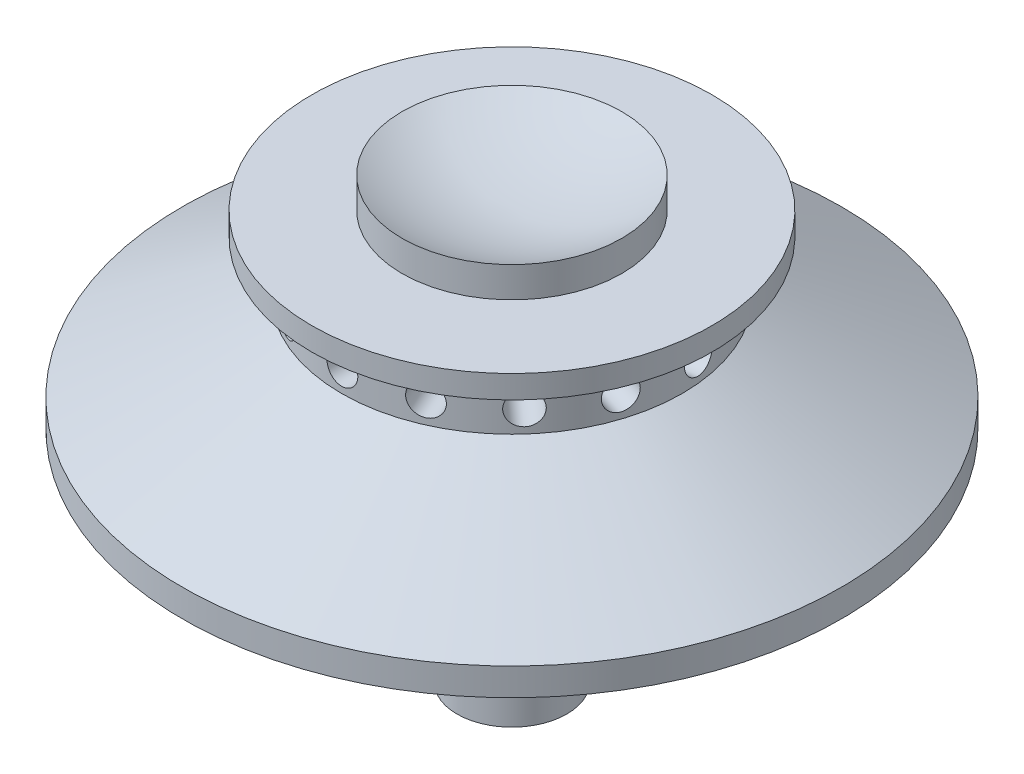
from build123d import *

# Parameters (mm, degrees)
CIRPATTERN1_COUNT = 15
SKETCH3_R         = 6.35
EXTRUDE1_DEPTH    = 25.4


with BuildPart() as part:
    # Sketch1 → Revolve1 (revolve)
    with BuildSketch(Plane.XY, mode=Mode.PRIVATE) as revolve1_sk:
        with BuildLine():
            Line((0, 0), (-38.1, 0))
            Line((-38.1, 0), (-38.1, 3.175))
            Line((-38.1, 3.175), (-19.683026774, 13.355449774))
            Line((-19.683026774, 13.355449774), (-19.683026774, 19.225285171))
            Line((-19.683026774, 19.225285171), (-23.130794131, 19.225285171))
            Line((-23.130794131, 19.225285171), (-23.130794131, 21.874102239))
            Line((-23.130794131, 21.874102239), (-12.7, 21.874102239))
            Line((-12.7, 21.874102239), (-12.7, 25.4))
            ThreePointArc((-12.7, 25.4), (-6.545430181, 23.030779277), (0, 22.225))
            Line((0, 22.225), (0, 0))
        make_face()
    revolve(revolve1_sk.sketch.rotate(Axis((0, 22.225, 0), (0, 1, 0)), 270), axis=Axis((0, 22.225, 0), (0, 1, 0)))

    # Sketch2 → 9_64 _0.14063_ Diameter Hole1 (revolve, cut)
    with BuildSketch(Plane(origin=(0, 15.875, 19.683026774), x_dir=(0, -1, 0), z_dir=(1, 0, 0))):
        Polygon((0, 0), (0, 13.773137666), (1.786001, 12.7), (1.786001, 0), align=None)
    f_9_64_0_14063_diameter_hole1 = revolve(axis=Axis((0, 15.875, 26.033026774), (0, 0, -1)), mode=Mode.SUBTRACT)

    # CirPattern1: 9_64 _0.14063_ Diameter Hole1 ×15 about axis
    cirpattern1_axis = Axis((0, 22.225, 0), (0, 1, 0))
    for i in range(1, CIRPATTERN1_COUNT):
        add(f_9_64_0_14063_diameter_hole1.rotate(cirpattern1_axis, i * 360 / CIRPATTERN1_COUNT), mode=Mode.SUBTRACT)

    # Sketch3 → Extrude1 (add)
    with BuildSketch(Plane.XZ):
        with Locations(Location((0, 0, 0), (0, 0, 90))):
            Circle(SKETCH3_R)
    extrude(amount=EXTRUDE1_DEPTH)


solid = part.part
